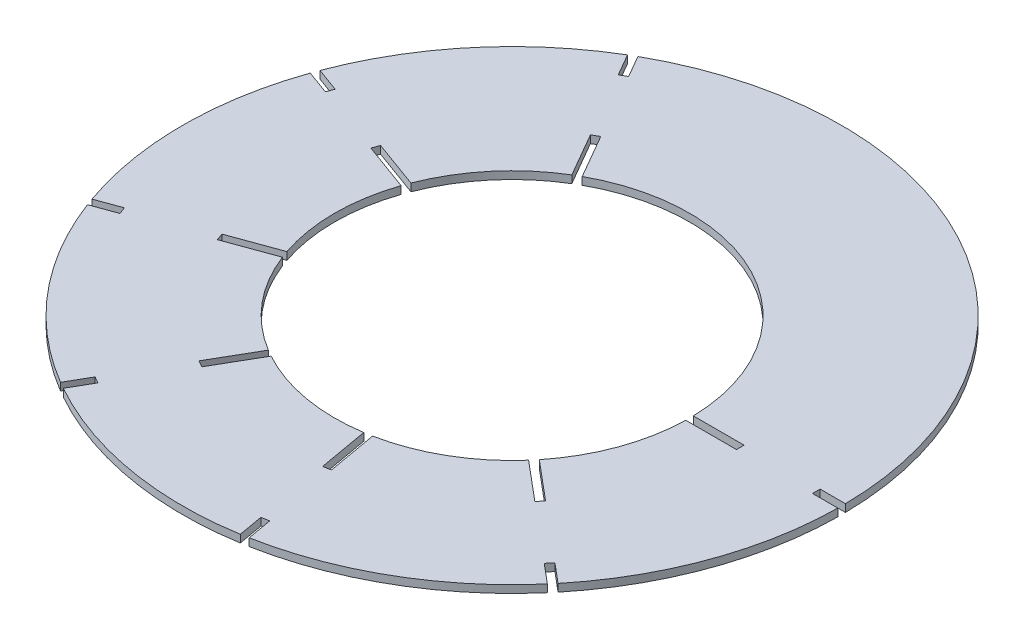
from build123d import *

# Parameters (mm, degrees)
SKETCH1_R           = 650
SKETCH1_R_2         = 350
BOSS_EXTRUDE1_DEPTH = 15
SKETCH2_W           = 100
SKETCH2_H           = 15
SKETCH2_W_2         = 105
CUT_EXTRUDE3_DEPTH  = 15


with BuildPart() as part:
    # Sketch1 → Boss-Extrude1 (new body)
    with BuildSketch(Plane(origin=(0, 0, 0), x_dir=(1, 0, 0), z_dir=(0, 1, 0))):
        with Locations(Location((0, 0, 0), (0, 0, 270))):
            Circle(SKETCH1_R)
        with Locations(Location((0, 0, 0), (0, 0, 270))):
            Circle(SKETCH1_R_2, mode=Mode.SUBTRACT)
    extrude(amount=BOSS_EXTRUDE1_DEPTH)

    # Sketch2 → Cut-Extrude3 (cut)
    with BuildSketch(Plane(origin=(0, 15, 0), x_dir=(1, 0, 0), z_dir=(0, 1, 0))):
        with Locations((650, 0)):
            Rectangle(SKETCH2_W, SKETCH2_H)
        with Locations((397.5, 0)):
            Rectangle(SKETCH2_W_2, SKETCH2_H)
        Polygon((111.574964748, -589.582290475), (128.939782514, -688.063065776), (114.167666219, -690.667788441), (96.802848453, -592.18701314), align=None)
        Polygon((67.294679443, -338.456313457), (85.527738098, -441.861127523), (70.755621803, -444.465850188), (52.522563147, -341.061036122), align=None)
        Polygon((464.447572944, -379.927232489), (541.052017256, -444.205993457), (531.410203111, -455.696660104), (454.805758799, -391.417899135), align=None)
        Polygon((269.106239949, -216.016392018), (349.540906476, -283.509091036), (339.899092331, -294.999757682), (259.464425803, -227.507058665), align=None)
        Polygon((-293.504809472, -523.365242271), (-343.504809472, -609.967782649), (-356.495190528, -602.467782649), (-306.495190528, -515.865242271), align=None)
        Polygon((-166.004809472, -302.528764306), (-218.504809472, -393.461431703), (-231.495190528, -385.961431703), (-178.995190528, -295.028764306), align=None)
        Polygon((-561.250421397, -212.259780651), (-655.219683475, -246.461794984), (-660.349985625, -232.366405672), (-566.380723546, -198.16439134), align=None)
        Polygon((-321.628803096, -125.044644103), (-420.296528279, -160.956759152), (-425.426830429, -146.861369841), (-326.759105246, -110.949254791), align=None)
        Polygon((-566.380723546, 198.16439134), (-660.349985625, 232.366405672), (-655.219683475, 246.461794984), (-561.250421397, 212.259780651), align=None)
        Polygon((-326.759105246, 110.949254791), (-425.426830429, 146.861369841), (-420.296528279, 160.956759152), (-321.628803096, 125.044644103), align=None)
        Polygon((-306.495190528, 515.865242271), (-356.495190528, 602.467782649), (-343.504809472, 609.967782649), (-293.504809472, 523.365242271), align=None)
        Polygon((-178.995190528, 295.028764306), (-231.495190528, 385.961431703), (-218.504809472, 393.461431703), (-166.004809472, 302.528764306), align=None)
    extrude(amount=-CUT_EXTRUDE3_DEPTH, mode=Mode.SUBTRACT)


solid = part.part
